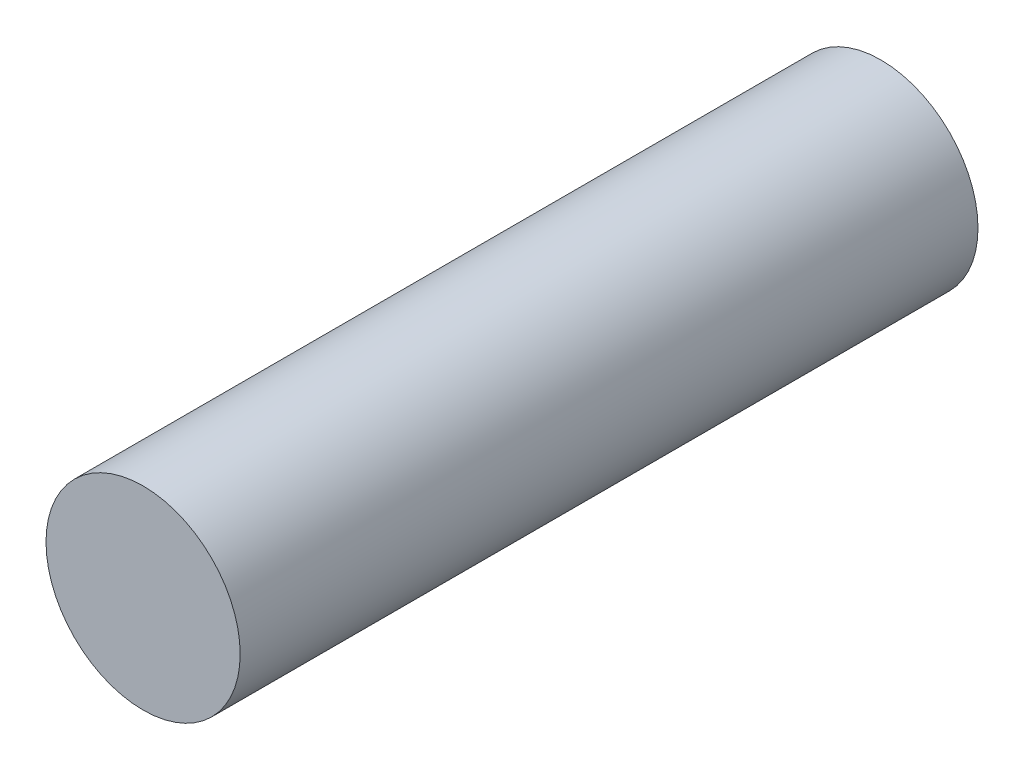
ISO-10303-21;
HEADER;
FILE_DESCRIPTION(('STEP AP214'),'2;1');
FILE_NAME('part.step','',(''),(''),'','','');
FILE_SCHEMA(('AUTOMOTIVE_DESIGN { 1 0 10303 214 1 1 1 1 }'));
ENDSEC;
DATA;
#1=APPLICATION_CONTEXT('core data for automotive mechanical design processes');
#2=APPLICATION_PROTOCOL_DEFINITION('international standard','automotive_design',2000,#1);
#3=PRODUCT_CONTEXT('',#1,'mechanical');
#4=PRODUCT('Part','Part','',(#3));
#5=PRODUCT_RELATED_PRODUCT_CATEGORY('part','',(#4));
#6=PRODUCT_DEFINITION_FORMATION('','',#4);
#7=PRODUCT_DEFINITION_CONTEXT('part definition',#1,'design');
#8=PRODUCT_DEFINITION('design','',#6,#7);
#9=PRODUCT_DEFINITION_SHAPE('','',#8);
#10=(LENGTH_UNIT() NAMED_UNIT(*) SI_UNIT(.MILLI.,.METRE.));
#11=(NAMED_UNIT(*) PLANE_ANGLE_UNIT() SI_UNIT($,.RADIAN.));
#12=(NAMED_UNIT(*) SI_UNIT($,.STERADIAN.) SOLID_ANGLE_UNIT());
#13=UNCERTAINTY_MEASURE_WITH_UNIT(LENGTH_MEASURE(1.E-05),#10,'distance_accuracy_value','');
#14=(GEOMETRIC_REPRESENTATION_CONTEXT(3) GLOBAL_UNCERTAINTY_ASSIGNED_CONTEXT((#13)) GLOBAL_UNIT_ASSIGNED_CONTEXT((#10,
#11,#12)) REPRESENTATION_CONTEXT('',''));
#15=CARTESIAN_POINT('',(0.,0.,0.));
#16=DIRECTION('',(0.,0.,1.));
#17=DIRECTION('',(1.,0.,0.));
#18=AXIS2_PLACEMENT_3D('',#15,#16,#17);
#19=CARTESIAN_POINT('',(0.,0.,95.));
#20=DIRECTION('',(0.,0.,-1.));
#21=DIRECTION('',(-1.,0.,0.));
#22=AXIS2_PLACEMENT_3D('',#19,#20,#21);
#23=CYLINDRICAL_SURFACE('',#22,12.5);
#24=CARTESIAN_POINT('',(0.,0.,95.));
#25=DIRECTION('',(0.,0.,1.));
#26=DIRECTION('',(1.,0.,0.));
#27=AXIS2_PLACEMENT_3D('',#24,#25,#26);
#28=CIRCLE('',#27,12.5);
#29=CARTESIAN_POINT('',(12.5,0.,95.));
#30=VERTEX_POINT('',#29);
#31=EDGE_CURVE('E10',#30,#30,#28,.T.);
#32=ORIENTED_EDGE('',*,*,#31,.F.);
#33=EDGE_LOOP('',(#32));
#34=FACE_BOUND('',#33,.T.);
#35=CARTESIAN_POINT('',(0.,0.,0.));
#36=DIRECTION('',(0.,0.,1.));
#37=DIRECTION('',(1.,0.,0.));
#38=AXIS2_PLACEMENT_3D('',#35,#36,#37);
#39=CIRCLE('',#38,12.5);
#40=CARTESIAN_POINT('',(12.5,0.,0.));
#41=VERTEX_POINT('',#40);
#42=EDGE_CURVE('E38',#41,#41,#39,.T.);
#43=ORIENTED_EDGE('',*,*,#42,.T.);
#44=EDGE_LOOP('',(#43));
#45=FACE_BOUND('',#44,.T.);
#46=ADVANCED_FACE('F35',(#34,#45),#23,.T.);
#47=CARTESIAN_POINT('',(0.,0.,95.));
#48=DIRECTION('',(0.,0.,1.));
#49=DIRECTION('',(1.,0.,0.));
#50=AXIS2_PLACEMENT_3D('',#47,#48,#49);
#51=PLANE('',#50);
#52=ORIENTED_EDGE('',*,*,#31,.T.);
#53=EDGE_LOOP('',(#52));
#54=FACE_BOUND('',#53,.T.);
#55=ADVANCED_FACE('F50',(#54),#51,.T.);
#56=CARTESIAN_POINT('',(0.,0.,0.));
#57=DIRECTION('',(0.,0.,1.));
#58=DIRECTION('',(1.,0.,0.));
#59=AXIS2_PLACEMENT_3D('',#56,#57,#58);
#60=PLANE('',#59);
#61=ORIENTED_EDGE('',*,*,#42,.F.);
#62=EDGE_LOOP('',(#61));
#63=FACE_BOUND('',#62,.T.);
#64=ADVANCED_FACE('F48',(#63),#60,.F.);
#65=CLOSED_SHELL('',(#46,#55,#64));
#66=MANIFOLD_SOLID_BREP('B2',#65);
#67=ADVANCED_BREP_SHAPE_REPRESENTATION('',(#18,#66),#14);
#68=SHAPE_DEFINITION_REPRESENTATION(#9,#67);
ENDSEC;
END-ISO-10303-21;
